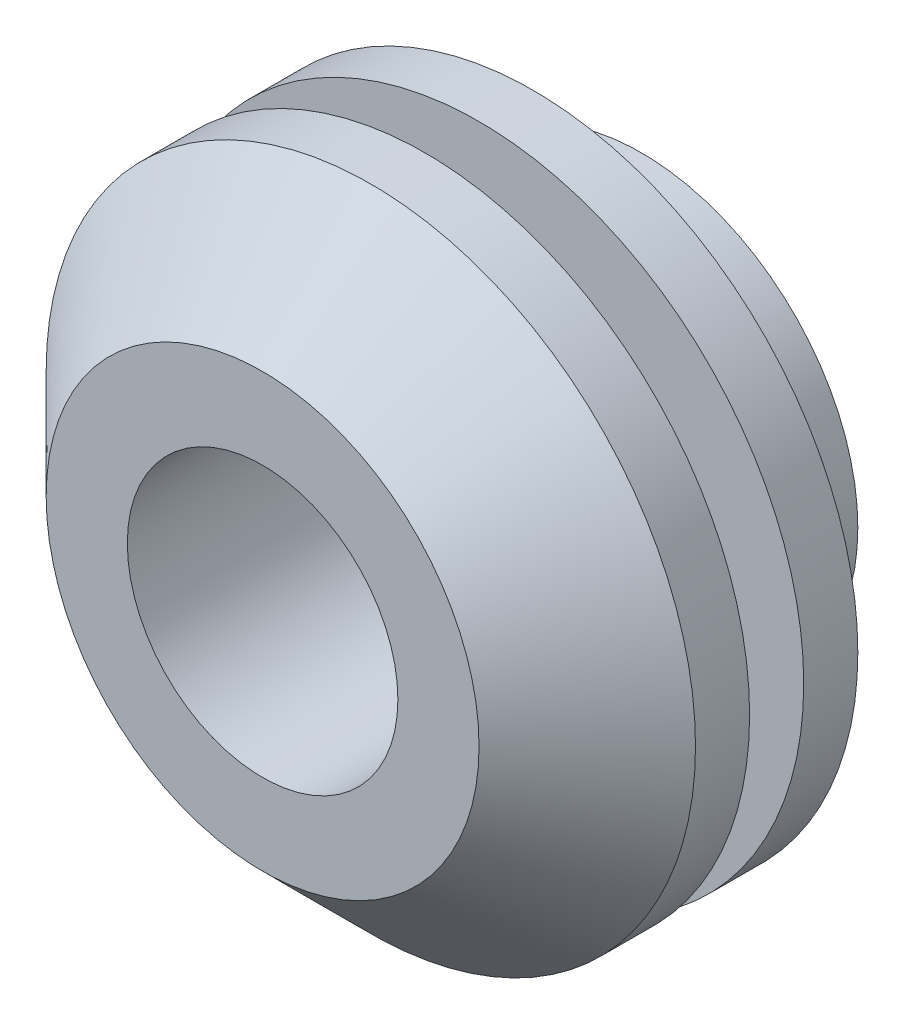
from build123d import *

# Parameters (mm, degrees)
ESQUISSE1_R             = 2
BASE_EXTRUSION_DEPTH    = 1
ESQUISSE2_R             = 3
BOSS_EXTRU_1_DEPTH      = 0.5
ESQUISSE3_R             = 2
BOSS_EXTRU_2_DEPTH      = 0.5
ESQUISSE4_R             = 3
BOSS_EXTRU_3_DEPTH      = 1.5
CHANFREIN1_SIZE         = 1
ESQUISSE5_R             = 1.25
ENL_V_MAT_EXTRU_1_DEPTH = 6.5


with BuildPart() as part:
    # Esquisse1 → Base-Extrusion (new body)
    with BuildSketch(Plane.XY):
        Circle(ESQUISSE1_R)
    extrude(amount=BASE_EXTRUSION_DEPTH)

    # Esquisse2 → Boss.-Extru.1 (add)
    with BuildSketch(Plane.XY.offset(1)):
        Circle(ESQUISSE2_R)
    extrude(amount=BOSS_EXTRU_1_DEPTH)

    # Esquisse3 → Boss.-Extru.2 (add)
    with BuildSketch(Plane.XY.offset(1.5)):
        Circle(ESQUISSE3_R)
    extrude(amount=BOSS_EXTRU_2_DEPTH)

    # Esquisse4 → Boss.-Extru.3 (add)
    with BuildSketch(Plane.XY.offset(2)):
        Circle(ESQUISSE4_R)
    extrude(amount=BOSS_EXTRU_3_DEPTH)

    # Chanfrein1
    chanfrein1_edges = [part.edges().sort_by_distance(p)[0] for p in [
        (-3, 0, 3.5),
    ]]
    chamfer(chanfrein1_edges, length=CHANFREIN1_SIZE)

    # Esquisse5 → Enl_v. mat.-Extru.1 (cut, through all)
    with BuildSketch(Plane.XY.offset(3.5)):
        Circle(ESQUISSE5_R)
    extrude(amount=-ENL_V_MAT_EXTRU_1_DEPTH, mode=Mode.SUBTRACT)


solid = part.part
